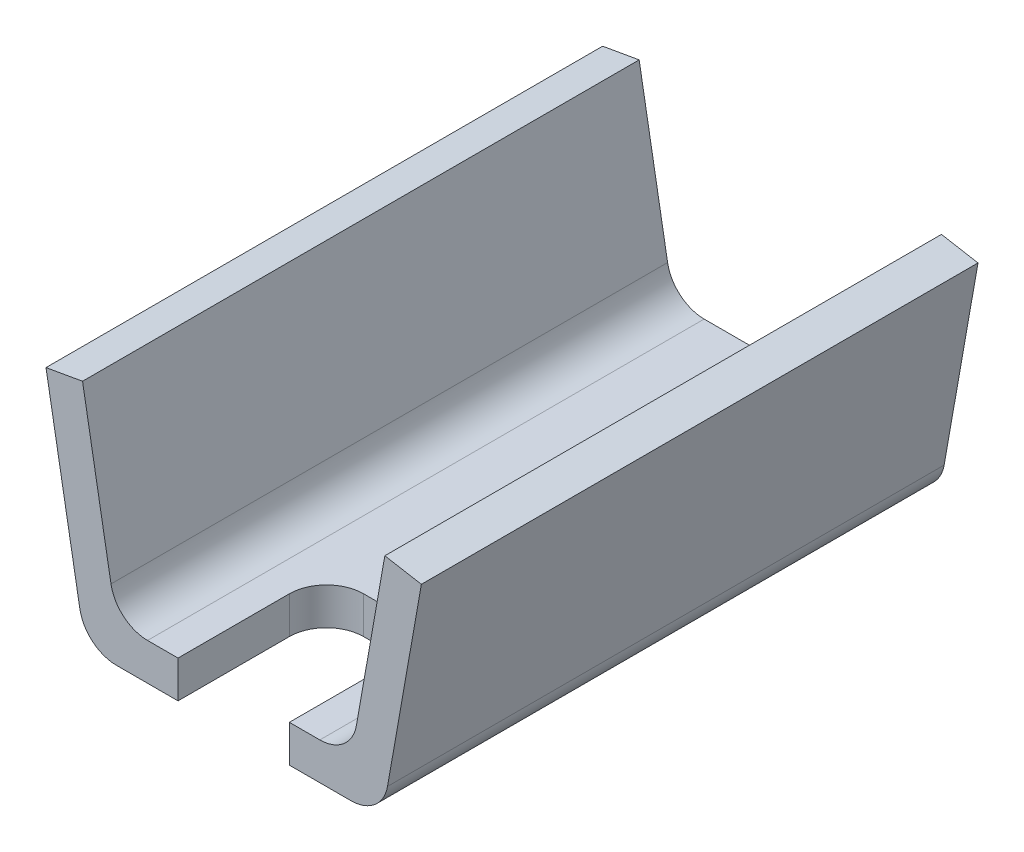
from build123d import *

# Parameters (mm, degrees)
EXTRUDE_1_DEPTH     = 75
SKETCH_2_W          = 15
SKETCH_2_H          = 11.100707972
CUT_EXTRUDE_1_DEPTH = 20
FILLET_1_R          = 5


with BuildPart() as part:
    # Sketch 1 → Extrude 1 (new body)
    with BuildSketch(Plane.XY):
        with BuildLine():
            Line((-15.804501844, 0), (15.804501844, 0))
            ThreePointArc((15.804501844, 0), (19.018439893, 1.169777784), (20.728540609, 4.131759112))
            Line((20.728540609, 4.131759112), (25.289809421, 30))
            Line((25.289809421, 30), (20.365770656, 30.868240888))
            Line((20.365770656, 30.868240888), (16.533042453, 9.131759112))
            ThreePointArc((16.533042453, 9.131759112), (14.822941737, 6.169777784), (11.609003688, 5))
            Line((11.609003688, 5), (-11.609003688, 5))
            ThreePointArc((-11.609003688, 5), (-14.822941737, 6.169777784), (-16.533042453, 9.131759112))
            Line((-16.533042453, 9.131759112), (-20.365770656, 30.868240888))
            Line((-20.365770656, 30.868240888), (-25.289809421, 30))
            Line((-25.289809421, 30), (-20.728540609, 4.131759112))
            ThreePointArc((-20.728540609, 4.131759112), (-19.018439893, 1.169777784), (-15.804501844, 0))
        make_face()
    extrude(amount=EXTRUDE_1_DEPTH)

    # Sketch 2 → Cut-Extrude 1 (cut)
    with BuildSketch(Plane.XY.offset(75)):
        with Locations((0, 1.832703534)):
            Rectangle(SKETCH_2_W, SKETCH_2_H)
    extrude(amount=-CUT_EXTRUDE_1_DEPTH, mode=Mode.SUBTRACT)

    # Fillet 1
    fillet_1_edges = [part.edges().sort_by_distance(p)[0] for p in [
        (-7.5, 2.5, 55),
        (7.5, 2.5, 55),
    ]]
    fillet(fillet_1_edges, radius=FILLET_1_R)


solid = part.part
